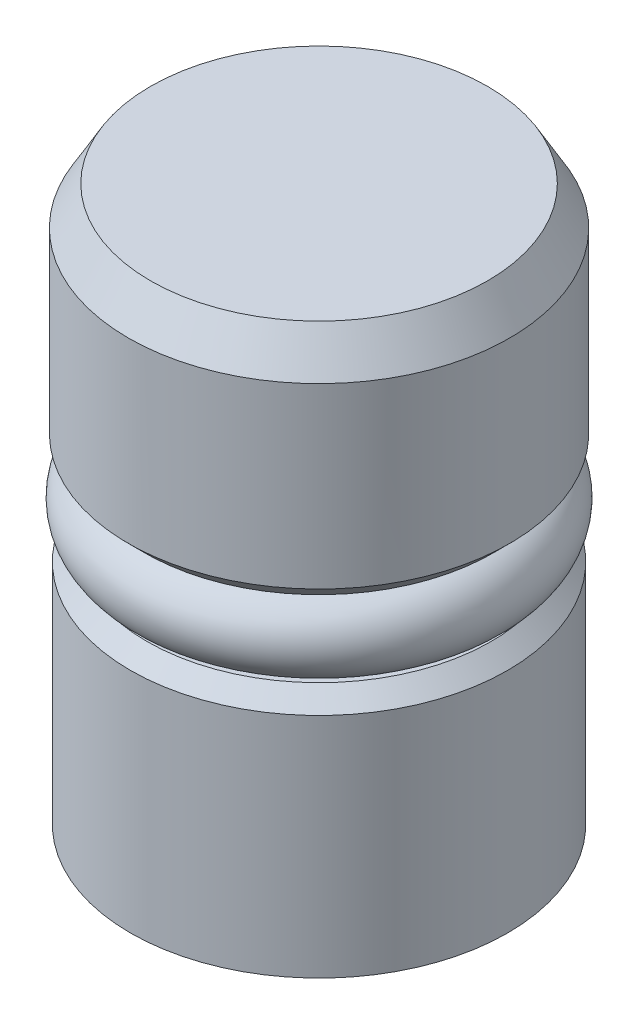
ISO-10303-21;
HEADER;
FILE_DESCRIPTION(('STEP AP214'),'2;1');
FILE_NAME('part.step','',(''),(''),'','','');
FILE_SCHEMA(('AUTOMOTIVE_DESIGN { 1 0 10303 214 1 1 1 1 }'));
ENDSEC;
DATA;
#1=APPLICATION_CONTEXT('core data for automotive mechanical design processes');
#2=APPLICATION_PROTOCOL_DEFINITION('international standard','automotive_design',2000,#1);
#3=PRODUCT_CONTEXT('',#1,'mechanical');
#4=PRODUCT('Part','Part','',(#3));
#5=PRODUCT_RELATED_PRODUCT_CATEGORY('part','',(#4));
#6=PRODUCT_DEFINITION_FORMATION('','',#4);
#7=PRODUCT_DEFINITION_CONTEXT('part definition',#1,'design');
#8=PRODUCT_DEFINITION('design','',#6,#7);
#9=PRODUCT_DEFINITION_SHAPE('','',#8);
#10=(LENGTH_UNIT() NAMED_UNIT(*) SI_UNIT(.MILLI.,.METRE.));
#11=(NAMED_UNIT(*) PLANE_ANGLE_UNIT() SI_UNIT($,.RADIAN.));
#12=(NAMED_UNIT(*) SI_UNIT($,.STERADIAN.) SOLID_ANGLE_UNIT());
#13=UNCERTAINTY_MEASURE_WITH_UNIT(LENGTH_MEASURE(1.E-05),#10,'distance_accuracy_value','');
#14=(GEOMETRIC_REPRESENTATION_CONTEXT(3) GLOBAL_UNCERTAINTY_ASSIGNED_CONTEXT((#13)) GLOBAL_UNIT_ASSIGNED_CONTEXT((#10,
#11,#12)) REPRESENTATION_CONTEXT('',''));
#15=CARTESIAN_POINT('',(0.,0.,0.));
#16=DIRECTION('',(0.,0.,1.));
#17=DIRECTION('',(1.,0.,0.));
#18=AXIS2_PLACEMENT_3D('',#15,#16,#17);
#19=CARTESIAN_POINT('',(0.,6.477,0.));
#20=DIRECTION('',(0.,-1.,0.));
#21=DIRECTION('',(0.,0.,-1.));
#22=AXIS2_PLACEMENT_3D('',#19,#20,#21);
#23=TOROIDAL_SURFACE('',#22,3.5306,0.889);
#24=CARTESIAN_POINT('',(0.,6.477,-4.4196));
#25=VERTEX_POINT('',#24);
#26=VERTEX_LOOP('',#25);
#27=FACE_BOUND('',#26,.T.);
#28=ADVANCED_FACE('P0_F11',(#27),#23,.T.);
#29=CLOSED_SHELL('',(#28));
#30=MANIFOLD_SOLID_BREP('P0_B1',#29);
#31=CARTESIAN_POINT('',(0.,2.4892,0.));
#32=DIRECTION('',(0.,1.,0.));
#33=DIRECTION('',(0.,0.,1.));
#34=AXIS2_PLACEMENT_3D('',#31,#32,#33);
#35=PLANE('',#34);
#36=CARTESIAN_POINT('',(0.,2.4892,0.));
#37=DIRECTION('',(0.,-1.,0.));
#38=DIRECTION('',(0.,0.,-1.));
#39=AXIS2_PLACEMENT_3D('',#36,#37,#38);
#40=CIRCLE('',#39,1.89865);
#41=CARTESIAN_POINT('',(0.,2.4892,-1.89865));
#42=VERTEX_POINT('',#41);
#43=EDGE_CURVE('P1_E47',#42,#42,#40,.T.);
#44=ORIENTED_EDGE('',*,*,#43,.T.);
#45=EDGE_LOOP('',(#44));
#46=FACE_BOUND('',#45,.T.);
#47=CARTESIAN_POINT('',(0.,2.4892,0.));
#48=DIRECTION('',(0.,-1.,0.));
#49=DIRECTION('',(0.,0.,-1.));
#50=AXIS2_PLACEMENT_3D('',#47,#48,#49);
#51=CIRCLE('',#50,1.35255);
#52=CARTESIAN_POINT('',(0.,2.4892,-1.35255));
#53=VERTEX_POINT('',#52);
#54=EDGE_CURVE('P1_E37',#53,#53,#51,.T.);
#55=ORIENTED_EDGE('',*,*,#54,.F.);
#56=EDGE_LOOP('',(#55));
#57=FACE_BOUND('',#56,.T.);
#58=ADVANCED_FACE('P1_F16',(#46,#57),#35,.F.);
#59=CARTESIAN_POINT('',(0.,0.,0.));
#60=DIRECTION('',(0.,-1.,0.));
#61=DIRECTION('',(0.,0.,-1.));
#62=AXIS2_PLACEMENT_3D('',#59,#60,#61);
#63=PLANE('',#62);
#64=CARTESIAN_POINT('',(0.,0.,0.));
#65=DIRECTION('',(0.,-1.,0.));
#66=DIRECTION('',(0.,0.,-1.));
#67=AXIS2_PLACEMENT_3D('',#64,#65,#66);
#68=CIRCLE('',#67,3.9848917);
#69=CARTESIAN_POINT('',(0.,0.,-3.9848917));
#70=VERTEX_POINT('',#69);
#71=EDGE_CURVE('P1_E36',#70,#70,#68,.T.);
#72=ORIENTED_EDGE('',*,*,#71,.F.);
#73=EDGE_LOOP('',(#72));
#74=FACE_BOUND('',#73,.T.);
#75=CARTESIAN_POINT('',(0.,0.,0.));
#76=DIRECTION('',(0.,-1.,0.));
#77=DIRECTION('',(0.,0.,-1.));
#78=AXIS2_PLACEMENT_3D('',#75,#76,#77);
#79=CIRCLE('',#78,4.318);
#80=CARTESIAN_POINT('',(0.,0.,-4.318));
#81=VERTEX_POINT('',#80);
#82=EDGE_CURVE('P1_E56',#81,#81,#79,.T.);
#83=ORIENTED_EDGE('',*,*,#82,.T.);
#84=EDGE_LOOP('',(#83));
#85=FACE_BOUND('',#84,.T.);
#86=ADVANCED_FACE('P1_F88',(#74,#85),#63,.T.);
#87=CARTESIAN_POINT('',(0.,0.,0.));
#88=DIRECTION('',(0.,-1.,0.));
#89=DIRECTION('',(0.,0.,-1.));
#90=AXIS2_PLACEMENT_3D('',#87,#88,#89);
#91=CYLINDRICAL_SURFACE('',#90,4.318);
#92=CARTESIAN_POINT('',(0.,5.207,0.));
#93=DIRECTION('',(0.,1.,0.));
#94=DIRECTION('',(0.,0.,1.));
#95=AXIS2_PLACEMENT_3D('',#92,#93,#94);
#96=CIRCLE('',#95,4.318);
#97=CARTESIAN_POINT('',(0.,5.207,4.318));
#98=VERTEX_POINT('',#97);
#99=EDGE_CURVE('P1_E59',#98,#98,#96,.F.);
#100=ORIENTED_EDGE('',*,*,#99,.T.);
#101=EDGE_LOOP('',(#100));
#102=FACE_BOUND('',#101,.T.);
#103=ORIENTED_EDGE('',*,*,#82,.F.);
#104=EDGE_LOOP('',(#103));
#105=FACE_BOUND('',#104,.T.);
#106=ADVANCED_FACE('P1_F95',(#102,#105),#91,.T.);
#107=CARTESIAN_POINT('',(4.318,5.588,0.));
#108=DIRECTION('',(0.,1.,0.));
#109=DIRECTION('',(0.,0.,1.));
#110=AXIS2_PLACEMENT_3D('',#107,#108,#109);
#111=PLANE('',#110);
#112=CARTESIAN_POINT('',(0.,5.588,0.));
#113=DIRECTION('',(0.,1.,0.));
#114=DIRECTION('',(0.,0.,1.));
#115=AXIS2_PLACEMENT_3D('',#112,#113,#114);
#116=CIRCLE('',#115,3.937);
#117=CARTESIAN_POINT('',(0.,5.588,3.937));
#118=VERTEX_POINT('',#117);
#119=EDGE_CURVE('P1_E62',#118,#118,#116,.T.);
#120=ORIENTED_EDGE('',*,*,#119,.T.);
#121=EDGE_LOOP('',(#120));
#122=FACE_BOUND('',#121,.T.);
#123=CARTESIAN_POINT('',(0.,5.588,0.));
#124=DIRECTION('',(0.,-1.,0.));
#125=DIRECTION('',(0.,0.,-1.));
#126=AXIS2_PLACEMENT_3D('',#123,#124,#125);
#127=CIRCLE('',#126,2.54);
#128=CARTESIAN_POINT('',(0.,5.588,-2.54));
#129=VERTEX_POINT('',#128);
#130=EDGE_CURVE('P1_E53',#129,#129,#127,.T.);
#131=ORIENTED_EDGE('',*,*,#130,.T.);
#132=EDGE_LOOP('',(#131));
#133=FACE_BOUND('',#132,.T.);
#134=ADVANCED_FACE('P1_F116',(#122,#133),#111,.T.);
#135=CARTESIAN_POINT('',(0.,0.,0.));
#136=DIRECTION('',(0.,-1.,0.));
#137=DIRECTION('',(0.,0.,-1.));
#138=AXIS2_PLACEMENT_3D('',#135,#136,#137);
#139=CYLINDRICAL_SURFACE('',#138,2.54);
#140=CARTESIAN_POINT('',(0.,7.366,0.));
#141=DIRECTION('',(0.,-1.,0.));
#142=DIRECTION('',(0.,0.,-1.));
#143=AXIS2_PLACEMENT_3D('',#140,#141,#142);
#144=CIRCLE('',#143,2.54);
#145=CARTESIAN_POINT('',(0.,7.366,-2.54));
#146=VERTEX_POINT('',#145);
#147=EDGE_CURVE('P1_E50',#146,#146,#144,.T.);
#148=ORIENTED_EDGE('',*,*,#147,.T.);
#149=EDGE_LOOP('',(#148));
#150=FACE_BOUND('',#149,.T.);
#151=ORIENTED_EDGE('',*,*,#130,.F.);
#152=EDGE_LOOP('',(#151));
#153=FACE_BOUND('',#152,.T.);
#154=ADVANCED_FACE('P1_F112',(#150,#153),#139,.T.);
#155=CARTESIAN_POINT('',(2.54,7.366,0.));
#156=DIRECTION('',(0.,-1.,0.));
#157=DIRECTION('',(0.,0.,-1.));
#158=AXIS2_PLACEMENT_3D('',#155,#156,#157);
#159=PLANE('',#158);
#160=CARTESIAN_POINT('',(0.,7.366,0.));
#161=DIRECTION('',(0.,-1.,0.));
#162=DIRECTION('',(0.,0.,-1.));
#163=AXIS2_PLACEMENT_3D('',#160,#161,#162);
#164=CIRCLE('',#163,3.984625);
#165=CARTESIAN_POINT('',(0.,7.366,-3.984625));
#166=VERTEX_POINT('',#165);
#167=EDGE_CURVE('P1_E65',#166,#166,#164,.T.);
#168=ORIENTED_EDGE('',*,*,#167,.T.);
#169=EDGE_LOOP('',(#168));
#170=FACE_BOUND('',#169,.T.);
#171=ORIENTED_EDGE('',*,*,#147,.F.);
#172=EDGE_LOOP('',(#171));
#173=FACE_BOUND('',#172,.T.);
#174=ADVANCED_FACE('P1_F109',(#170,#173),#159,.T.);
#175=CARTESIAN_POINT('',(0.,0.,0.));
#176=DIRECTION('',(0.,-1.,0.));
#177=DIRECTION('',(0.,0.,-1.));
#178=AXIS2_PLACEMENT_3D('',#175,#176,#177);
#179=CYLINDRICAL_SURFACE('',#178,4.365625);
#180=CARTESIAN_POINT('',(0.,11.820118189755,0.));
#181=DIRECTION('',(0.,1.,0.));
#182=DIRECTION('',(0.,0.,1.));
#183=AXIS2_PLACEMENT_3D('',#180,#181,#182);
#184=CIRCLE('',#183,4.365625);
#185=CARTESIAN_POINT('',(0.,11.820118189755,4.365625));
#186=VERTEX_POINT('',#185);
#187=EDGE_CURVE('P1_E23',#186,#186,#184,.F.);
#188=ORIENTED_EDGE('',*,*,#187,.T.);
#189=EDGE_LOOP('',(#188));
#190=FACE_BOUND('',#189,.T.);
#191=CARTESIAN_POINT('',(0.,7.747,0.));
#192=DIRECTION('',(0.,-1.,0.));
#193=DIRECTION('',(0.,0.,-1.));
#194=AXIS2_PLACEMENT_3D('',#191,#192,#193);
#195=CIRCLE('',#194,4.365625);
#196=CARTESIAN_POINT('',(0.,7.747,-4.365625));
#197=VERTEX_POINT('',#196);
#198=EDGE_CURVE('P1_E68',#197,#197,#195,.F.);
#199=ORIENTED_EDGE('',*,*,#198,.T.);
#200=EDGE_LOOP('',(#199));
#201=FACE_BOUND('',#200,.T.);
#202=ADVANCED_FACE('P1_F73',(#190,#201),#179,.T.);
#203=CARTESIAN_POINT('',(4.365625,12.7,0.));
#204=DIRECTION('',(0.,1.,0.));
#205=DIRECTION('',(0.,0.,1.));
#206=AXIS2_PLACEMENT_3D('',#203,#204,#205);
#207=PLANE('',#206);
#208=CARTESIAN_POINT('',(0.,12.7,0.));
#209=DIRECTION('',(0.,1.,0.));
#210=DIRECTION('',(0.,0.,1.));
#211=AXIS2_PLACEMENT_3D('',#208,#209,#210);
#212=CIRCLE('',#211,3.857625);
#213=CARTESIAN_POINT('',(0.,12.7,3.857625));
#214=VERTEX_POINT('',#213);
#215=EDGE_CURVE('P1_E11',#214,#214,#212,.T.);
#216=ORIENTED_EDGE('',*,*,#215,.T.);
#217=EDGE_LOOP('',(#216));
#218=FACE_BOUND('',#217,.T.);
#219=ADVANCED_FACE('P1_F103',(#218),#207,.T.);
#220=CARTESIAN_POINT('',(0.,0.,0.));
#221=DIRECTION('',(0.,-1.,0.));
#222=DIRECTION('',(0.,0.,-1.));
#223=AXIS2_PLACEMENT_3D('',#220,#221,#222);
#224=CYLINDRICAL_SURFACE('',#223,1.89865);
#225=ORIENTED_EDGE('',*,*,#43,.F.);
#226=EDGE_LOOP('',(#225));
#227=FACE_BOUND('',#226,.T.);
#228=CARTESIAN_POINT('',(0.,2.39994654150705,0.));
#229=DIRECTION('',(0.,-1.,0.));
#230=DIRECTION('',(0.,0.,-1.));
#231=AXIS2_PLACEMENT_3D('',#228,#229,#230);
#232=CIRCLE('',#231,1.89865);
#233=CARTESIAN_POINT('',(0.,2.39994654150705,-1.89865));
#234=VERTEX_POINT('',#233);
#235=EDGE_CURVE('P1_E40',#234,#234,#232,.T.);
#236=ORIENTED_EDGE('',*,*,#235,.T.);
#237=EDGE_LOOP('',(#236));
#238=FACE_BOUND('',#237,.T.);
#239=ADVANCED_FACE('P1_F101',(#227,#238),#224,.F.);
#240=CARTESIAN_POINT('',(0.,0.,0.));
#241=DIRECTION('',(0.,-1.,0.));
#242=DIRECTION('',(0.,0.,-1.));
#243=AXIS2_PLACEMENT_3D('',#240,#241,#242);
#244=CONICAL_SURFACE('',#243,3.9848917,0.715584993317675);
#245=ORIENTED_EDGE('',*,*,#235,.F.);
#246=EDGE_LOOP('',(#245));
#247=FACE_BOUND('',#246,.T.);
#248=ORIENTED_EDGE('',*,*,#71,.T.);
#249=EDGE_LOOP('',(#248));
#250=FACE_BOUND('',#249,.T.);
#251=ADVANCED_FACE('P1_F30',(#247,#250),#244,.F.);
#252=CARTESIAN_POINT('',(0.,10.414,0.));
#253=DIRECTION('',(0.,-1.,0.));
#254=DIRECTION('',(0.,0.,-1.));
#255=AXIS2_PLACEMENT_3D('',#252,#253,#254);
#256=CONICAL_SURFACE('',#255,1.35255,1.02974425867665);
#257=CARTESIAN_POINT('',(0.,11.2266940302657,0.));
#258=VERTEX_POINT('',#257);
#259=VERTEX_LOOP('',#258);
#260=FACE_BOUND('',#259,.T.);
#261=CARTESIAN_POINT('',(0.,10.414,0.));
#262=DIRECTION('',(0.,-1.,0.));
#263=DIRECTION('',(0.,0.,-1.));
#264=AXIS2_PLACEMENT_3D('',#261,#262,#263);
#265=CIRCLE('',#264,1.35255);
#266=CARTESIAN_POINT('',(0.,10.414,-1.35255));
#267=VERTEX_POINT('',#266);
#268=EDGE_CURVE('P1_E34',#267,#267,#265,.T.);
#269=ORIENTED_EDGE('',*,*,#268,.T.);
#270=EDGE_LOOP('',(#269));
#271=FACE_BOUND('',#270,.T.);
#272=ADVANCED_FACE('P1_F26',(#260,#271),#256,.F.);
#273=CARTESIAN_POINT('',(0.,2.4892,0.));
#274=DIRECTION('',(0.,-1.,0.));
#275=DIRECTION('',(0.,0.,-1.));
#276=AXIS2_PLACEMENT_3D('',#273,#274,#275);
#277=CYLINDRICAL_SURFACE('',#276,1.35255);
#278=ORIENTED_EDGE('',*,*,#268,.F.);
#279=EDGE_LOOP('',(#278));
#280=FACE_BOUND('',#279,.T.);
#281=ORIENTED_EDGE('',*,*,#54,.T.);
#282=EDGE_LOOP('',(#281));
#283=FACE_BOUND('',#282,.T.);
#284=ADVANCED_FACE('P1_F29',(#280,#283),#277,.F.);
#285=CARTESIAN_POINT('',(0.,5.207,0.));
#286=DIRECTION('',(0.,-1.,0.));
#287=DIRECTION('',(0.,0.,-1.));
#288=AXIS2_PLACEMENT_3D('',#285,#286,#287);
#289=CONICAL_SURFACE('',#288,4.318,0.78539816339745);
#290=ORIENTED_EDGE('',*,*,#119,.F.);
#291=EDGE_LOOP('',(#290));
#292=FACE_BOUND('',#291,.T.);
#293=ORIENTED_EDGE('',*,*,#99,.F.);
#294=EDGE_LOOP('',(#293));
#295=FACE_BOUND('',#294,.T.);
#296=ADVANCED_FACE('P1_F84',(#292,#295),#289,.T.);
#297=CARTESIAN_POINT('',(0.,7.366,0.));
#298=DIRECTION('',(0.,1.,0.));
#299=DIRECTION('',(0.,0.,1.));
#300=AXIS2_PLACEMENT_3D('',#297,#298,#299);
#301=CONICAL_SURFACE('',#300,3.984625,0.785398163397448);
#302=ORIENTED_EDGE('',*,*,#198,.F.);
#303=EDGE_LOOP('',(#302));
#304=FACE_BOUND('',#303,.T.);
#305=ORIENTED_EDGE('',*,*,#167,.F.);
#306=EDGE_LOOP('',(#305));
#307=FACE_BOUND('',#306,.T.);
#308=ADVANCED_FACE('P1_F77',(#304,#307),#301,.T.);
#309=CARTESIAN_POINT('',(0.,11.820118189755,0.));
#310=DIRECTION('',(0.,-1.,0.));
#311=DIRECTION('',(0.,0.,-1.));
#312=AXIS2_PLACEMENT_3D('',#309,#310,#311);
#313=CONICAL_SURFACE('',#312,4.365625,0.523598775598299);
#314=ORIENTED_EDGE('',*,*,#215,.F.);
#315=EDGE_LOOP('',(#314));
#316=FACE_BOUND('',#315,.T.);
#317=ORIENTED_EDGE('',*,*,#187,.F.);
#318=EDGE_LOOP('',(#317));
#319=FACE_BOUND('',#318,.T.);
#320=ADVANCED_FACE('P1_F18',(#316,#319),#313,.T.);
#321=CLOSED_SHELL('',(#58,#86,#106,#134,#154,#174,#202,#219,#239,#251,#272,#284,#296,#308,#320));
#322=MANIFOLD_SOLID_BREP('P1_B1',#321);
#323=CARTESIAN_POINT('',(0.,8.03642213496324,0.));
#324=DIRECTION('',(0.,1.,0.));
#325=DIRECTION('',(1.,0.,0.));
#326=AXIS2_PLACEMENT_3D('',#323,#324,#325);
#327=PLANE('',#326);
#328=CARTESIAN_POINT('',(0.,8.03642213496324,0.));
#329=DIRECTION('',(0.,1.,0.));
#330=DIRECTION('',(1.,0.,0.));
#331=AXIS2_PLACEMENT_3D('',#328,#329,#330);
#332=CIRCLE('',#331,1.7526);
#333=CARTESIAN_POINT('',(1.7526,8.03642213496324,0.));
#334=VERTEX_POINT('',#333);
#335=EDGE_CURVE('P2_E10',#334,#334,#332,.T.);
#336=ORIENTED_EDGE('',*,*,#335,.T.);
#337=EDGE_LOOP('',(#336));
#338=FACE_BOUND('',#337,.T.);
#339=ADVANCED_FACE('P2_F15',(#338),#327,.T.);
#340=CARTESIAN_POINT('',(0.,8.03642213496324,0.));
#341=DIRECTION('',(0.,1.,0.));
#342=DIRECTION('',(1.,0.,0.));
#343=AXIS2_PLACEMENT_3D('',#340,#341,#342);
#344=CYLINDRICAL_SURFACE('',#343,1.7526);
#345=CARTESIAN_POINT('',(0.,2.56795784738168,0.));
#346=DIRECTION('',(0.,1.,0.));
#347=DIRECTION('',(1.,0.,0.));
#348=AXIS2_PLACEMENT_3D('',#345,#346,#347);
#349=CIRCLE('',#348,1.7526);
#350=CARTESIAN_POINT('',(1.7526,2.56795784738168,0.));
#351=VERTEX_POINT('',#350);
#352=EDGE_CURVE('P2_E22',#351,#351,#349,.T.);
#353=ORIENTED_EDGE('',*,*,#352,.T.);
#354=EDGE_LOOP('',(#353));
#355=FACE_BOUND('',#354,.T.);
#356=ORIENTED_EDGE('',*,*,#335,.F.);
#357=EDGE_LOOP('',(#356));
#358=FACE_BOUND('',#357,.T.);
#359=ADVANCED_FACE('P2_F126',(#355,#358),#344,.T.);
#360=CARTESIAN_POINT('',(0.,2.56795784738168,0.));
#361=DIRECTION('',(0.,-1.,0.));
#362=DIRECTION('',(-1.,0.,0.));
#363=AXIS2_PLACEMENT_3D('',#360,#361,#362);
#364=CONICAL_SURFACE('',#363,1.7526,0.715584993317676);
#365=CARTESIAN_POINT('',(0.,0.0989221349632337,0.));
#366=DIRECTION('',(0.,1.,0.));
#367=DIRECTION('',(1.,0.,0.));
#368=AXIS2_PLACEMENT_3D('',#365,#366,#367);
#369=CIRCLE('',#368,3.8989);
#370=CARTESIAN_POINT('',(3.8989,0.0989221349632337,0.));
#371=VERTEX_POINT('',#370);
#372=EDGE_CURVE('P2_E116',#371,#371,#369,.T.);
#373=ORIENTED_EDGE('',*,*,#372,.T.);
#374=EDGE_LOOP('',(#373));
#375=FACE_BOUND('',#374,.T.);
#376=ORIENTED_EDGE('',*,*,#352,.F.);
#377=EDGE_LOOP('',(#376));
#378=FACE_BOUND('',#377,.T.);
#379=ADVANCED_FACE('P2_F129',(#375,#378),#364,.T.);
#380=CARTESIAN_POINT('',(0.,0.0989221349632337,3.8989));
#381=DIRECTION('',(0.,-1.,0.));
#382=DIRECTION('',(-1.,0.,0.));
#383=AXIS2_PLACEMENT_3D('',#380,#381,#382);
#384=PLANE('',#383);
#385=DIRECTION('',(0.866025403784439,0.,0.5));
#386=VECTOR('',#385,1.);
#387=CARTESIAN_POINT('',(0.,0.0989221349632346,-1.14384635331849));
#388=LINE('',#387,#386);
#389=CARTESIAN_POINT('',(0.,0.0989221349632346,-1.14384635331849));
#390=VERTEX_POINT('',#389);
#391=CARTESIAN_POINT('',(0.9906,0.0989221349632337,-0.571923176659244));
#392=VERTEX_POINT('',#391);
#393=EDGE_CURVE('P2_E29',#390,#392,#388,.T.);
#394=ORIENTED_EDGE('',*,*,#393,.F.);
#395=DIRECTION('',(0.866025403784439,0.,-0.5));
#396=VECTOR('',#395,1.);
#397=CARTESIAN_POINT('',(-0.9906,0.0989221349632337,-0.571923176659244));
#398=LINE('',#397,#396);
#399=CARTESIAN_POINT('',(-0.9906,0.0989221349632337,-0.571923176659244));
#400=VERTEX_POINT('',#399);
#401=EDGE_CURVE('P2_E112',#400,#390,#398,.T.);
#402=ORIENTED_EDGE('',*,*,#401,.F.);
#403=DIRECTION('',(0.,0.,-1.));
#404=VECTOR('',#403,1.);
#405=CARTESIAN_POINT('',(-0.9906,0.0989221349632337,0.571923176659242));
#406=LINE('',#405,#404);
#407=CARTESIAN_POINT('',(-0.9906,0.0989221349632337,0.571923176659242));
#408=VERTEX_POINT('',#407);
#409=EDGE_CURVE('P2_E110',#408,#400,#406,.T.);
#410=ORIENTED_EDGE('',*,*,#409,.F.);
#411=DIRECTION('',(-0.866025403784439,0.,-0.5));
#412=VECTOR('',#411,1.);
#413=CARTESIAN_POINT('',(0.,0.0989221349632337,1.14384635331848));
#414=LINE('',#413,#412);
#415=CARTESIAN_POINT('',(0.,0.0989221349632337,1.14384635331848));
#416=VERTEX_POINT('',#415);
#417=EDGE_CURVE('P2_E77',#416,#408,#414,.T.);
#418=ORIENTED_EDGE('',*,*,#417,.F.);
#419=DIRECTION('',(-0.866025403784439,0.,0.5));
#420=VECTOR('',#419,1.);
#421=CARTESIAN_POINT('',(0.9906,0.0989221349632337,0.571923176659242));
#422=LINE('',#421,#420);
#423=CARTESIAN_POINT('',(0.9906,0.0989221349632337,0.571923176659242));
#424=VERTEX_POINT('',#423);
#425=EDGE_CURVE('P2_E106',#424,#416,#422,.T.);
#426=ORIENTED_EDGE('',*,*,#425,.F.);
#427=DIRECTION('',(0.,0.,1.));
#428=VECTOR('',#427,1.);
#429=CARTESIAN_POINT('',(0.9906,0.0989221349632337,-0.571923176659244));
#430=LINE('',#429,#428);
#431=EDGE_CURVE('P2_E103',#392,#424,#430,.T.);
#432=ORIENTED_EDGE('',*,*,#431,.F.);
#433=EDGE_LOOP('',(#394,#402,#410,#418,#426,#432));
#434=FACE_BOUND('',#433,.T.);
#435=ORIENTED_EDGE('',*,*,#372,.F.);
#436=EDGE_LOOP('',(#435));
#437=FACE_BOUND('',#436,.T.);
#438=ADVANCED_FACE('P2_F131',(#434,#437),#384,.T.);
#439=CARTESIAN_POINT('',(0.,2.13092213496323,-1.14384635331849));
#440=DIRECTION('',(0.5,0.,-0.866025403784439));
#441=DIRECTION('',(-0.866025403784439,0.,-0.5));
#442=AXIS2_PLACEMENT_3D('',#439,#440,#441);
#443=PLANE('',#442);
#444=ORIENTED_EDGE('',*,*,#393,.T.);
#445=DIRECTION('',(0.,-1.,0.));
#446=VECTOR('',#445,1.);
#447=CARTESIAN_POINT('',(0.9906,2.13092213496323,-0.571923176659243));
#448=LINE('',#447,#446);
#449=CARTESIAN_POINT('',(0.9906,2.13092213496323,-0.571923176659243));
#450=VERTEX_POINT('',#449);
#451=EDGE_CURVE('P2_E59',#450,#392,#448,.T.);
#452=ORIENTED_EDGE('',*,*,#451,.F.);
#453=DIRECTION('',(0.866025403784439,0.,0.5));
#454=VECTOR('',#453,1.);
#455=CARTESIAN_POINT('',(0.,2.13092213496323,-1.14384635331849));
#456=LINE('',#455,#454);
#457=CARTESIAN_POINT('',(0.,2.13092213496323,-1.14384635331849));
#458=VERTEX_POINT('',#457);
#459=EDGE_CURVE('P2_E114',#458,#450,#456,.T.);
#460=ORIENTED_EDGE('',*,*,#459,.F.);
#461=DIRECTION('',(0.,-1.,0.));
#462=VECTOR('',#461,1.);
#463=CARTESIAN_POINT('',(0.,2.13092213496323,-1.14384635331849));
#464=LINE('',#463,#462);
#465=EDGE_CURVE('P2_E37',#458,#390,#464,.T.);
#466=ORIENTED_EDGE('',*,*,#465,.T.);
#467=EDGE_LOOP('',(#444,#452,#460,#466));
#468=FACE_BOUND('',#467,.T.);
#469=ADVANCED_FACE('P2_F140',(#468),#443,.F.);
#470=CARTESIAN_POINT('',(-0.9906,2.13092213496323,-0.571923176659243));
#471=DIRECTION('',(-0.5,0.,-0.866025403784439));
#472=DIRECTION('',(-0.866025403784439,0.,0.5));
#473=AXIS2_PLACEMENT_3D('',#470,#471,#472);
#474=PLANE('',#473);
#475=ORIENTED_EDGE('',*,*,#401,.T.);
#476=ORIENTED_EDGE('',*,*,#465,.F.);
#477=DIRECTION('',(0.866025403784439,0.,-0.5));
#478=VECTOR('',#477,1.);
#479=CARTESIAN_POINT('',(-0.9906,2.13092213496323,-0.571923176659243));
#480=LINE('',#479,#478);
#481=CARTESIAN_POINT('',(-0.9906,2.13092213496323,-0.571923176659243));
#482=VERTEX_POINT('',#481);
#483=EDGE_CURVE('P2_E89',#482,#458,#480,.T.);
#484=ORIENTED_EDGE('',*,*,#483,.F.);
#485=DIRECTION('',(0.,-1.,0.));
#486=VECTOR('',#485,1.);
#487=CARTESIAN_POINT('',(-0.9906,2.13092213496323,-0.571923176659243));
#488=LINE('',#487,#486);
#489=EDGE_CURVE('P2_E81',#482,#400,#488,.T.);
#490=ORIENTED_EDGE('',*,*,#489,.T.);
#491=EDGE_LOOP('',(#475,#476,#484,#490));
#492=FACE_BOUND('',#491,.T.);
#493=ADVANCED_FACE('P2_F179',(#492),#474,.F.);
#494=CARTESIAN_POINT('',(-0.9906,2.13092213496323,0.571923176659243));
#495=DIRECTION('',(-1.,0.,0.));
#496=DIRECTION('',(0.,1.,0.));
#497=AXIS2_PLACEMENT_3D('',#494,#495,#496);
#498=PLANE('',#497);
#499=ORIENTED_EDGE('',*,*,#409,.T.);
#500=ORIENTED_EDGE('',*,*,#489,.F.);
#501=DIRECTION('',(0.,0.,-1.));
#502=VECTOR('',#501,1.);
#503=CARTESIAN_POINT('',(-0.9906,2.13092213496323,0.571923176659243));
#504=LINE('',#503,#502);
#505=CARTESIAN_POINT('',(-0.9906,2.13092213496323,0.571923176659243));
#506=VERTEX_POINT('',#505);
#507=EDGE_CURVE('P2_E85',#506,#482,#504,.T.);
#508=ORIENTED_EDGE('',*,*,#507,.F.);
#509=DIRECTION('',(0.,-1.,0.));
#510=VECTOR('',#509,1.);
#511=CARTESIAN_POINT('',(-0.9906,2.13092213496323,0.571923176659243));
#512=LINE('',#511,#510);
#513=EDGE_CURVE('P2_E70',#506,#408,#512,.T.);
#514=ORIENTED_EDGE('',*,*,#513,.T.);
#515=EDGE_LOOP('',(#499,#500,#508,#514));
#516=FACE_BOUND('',#515,.T.);
#517=ADVANCED_FACE('P2_F86',(#516),#498,.F.);
#518=CARTESIAN_POINT('',(0.,2.13092213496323,1.14384635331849));
#519=DIRECTION('',(-0.5,0.,0.866025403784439));
#520=DIRECTION('',(0.866025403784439,0.,0.5));
#521=AXIS2_PLACEMENT_3D('',#518,#519,#520);
#522=PLANE('',#521);
#523=ORIENTED_EDGE('',*,*,#417,.T.);
#524=ORIENTED_EDGE('',*,*,#513,.F.);
#525=DIRECTION('',(-0.866025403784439,0.,-0.5));
#526=VECTOR('',#525,1.);
#527=CARTESIAN_POINT('',(0.,2.13092213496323,1.14384635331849));
#528=LINE('',#527,#526);
#529=CARTESIAN_POINT('',(0.,2.13092213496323,1.14384635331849));
#530=VERTEX_POINT('',#529);
#531=EDGE_CURVE('P2_E74',#530,#506,#528,.T.);
#532=ORIENTED_EDGE('',*,*,#531,.F.);
#533=DIRECTION('',(0.,-1.,0.));
#534=VECTOR('',#533,1.);
#535=CARTESIAN_POINT('',(0.,2.13092213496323,1.14384635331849));
#536=LINE('',#535,#534);
#537=EDGE_CURVE('P2_E82',#530,#416,#536,.T.);
#538=ORIENTED_EDGE('',*,*,#537,.T.);
#539=EDGE_LOOP('',(#523,#524,#532,#538));
#540=FACE_BOUND('',#539,.T.);
#541=ADVANCED_FACE('P2_F72',(#540),#522,.F.);
#542=CARTESIAN_POINT('',(0.9906,2.13092213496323,0.571923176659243));
#543=DIRECTION('',(0.5,0.,0.866025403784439));
#544=DIRECTION('',(0.866025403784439,0.,-0.5));
#545=AXIS2_PLACEMENT_3D('',#542,#543,#544);
#546=PLANE('',#545);
#547=ORIENTED_EDGE('',*,*,#425,.T.);
#548=ORIENTED_EDGE('',*,*,#537,.F.);
#549=DIRECTION('',(-0.866025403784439,0.,0.5));
#550=VECTOR('',#549,1.);
#551=CARTESIAN_POINT('',(0.9906,2.13092213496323,0.571923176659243));
#552=LINE('',#551,#550);
#553=CARTESIAN_POINT('',(0.9906,2.13092213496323,0.571923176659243));
#554=VERTEX_POINT('',#553);
#555=EDGE_CURVE('P2_E95',#554,#530,#552,.T.);
#556=ORIENTED_EDGE('',*,*,#555,.F.);
#557=DIRECTION('',(0.,-1.,0.));
#558=VECTOR('',#557,1.);
#559=CARTESIAN_POINT('',(0.9906,2.13092213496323,0.571923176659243));
#560=LINE('',#559,#558);
#561=EDGE_CURVE('P2_E119',#554,#424,#560,.T.);
#562=ORIENTED_EDGE('',*,*,#561,.T.);
#563=EDGE_LOOP('',(#547,#548,#556,#562));
#564=FACE_BOUND('',#563,.T.);
#565=ADVANCED_FACE('P2_F200',(#564),#546,.F.);
#566=CARTESIAN_POINT('',(0.9906,2.13092213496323,-0.571923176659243));
#567=DIRECTION('',(1.,0.,0.));
#568=DIRECTION('',(0.,-1.,0.));
#569=AXIS2_PLACEMENT_3D('',#566,#567,#568);
#570=PLANE('',#569);
#571=ORIENTED_EDGE('',*,*,#431,.T.);
#572=ORIENTED_EDGE('',*,*,#561,.F.);
#573=DIRECTION('',(0.,0.,1.));
#574=VECTOR('',#573,1.);
#575=CARTESIAN_POINT('',(0.9906,2.13092213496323,-0.571923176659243));
#576=LINE('',#575,#574);
#577=EDGE_CURVE('P2_E97',#450,#554,#576,.T.);
#578=ORIENTED_EDGE('',*,*,#577,.F.);
#579=ORIENTED_EDGE('',*,*,#451,.T.);
#580=EDGE_LOOP('',(#571,#572,#578,#579));
#581=FACE_BOUND('',#580,.T.);
#582=ADVANCED_FACE('P2_F208',(#581),#570,.F.);
#583=CARTESIAN_POINT('',(0.,2.13092213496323,-1.14384635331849));
#584=DIRECTION('',(0.,1.,0.));
#585=DIRECTION('',(1.,0.,0.));
#586=AXIS2_PLACEMENT_3D('',#583,#584,#585);
#587=PLANE('',#586);
#588=ORIENTED_EDGE('',*,*,#459,.T.);
#589=ORIENTED_EDGE('',*,*,#577,.T.);
#590=ORIENTED_EDGE('',*,*,#555,.T.);
#591=ORIENTED_EDGE('',*,*,#531,.T.);
#592=ORIENTED_EDGE('',*,*,#507,.T.);
#593=ORIENTED_EDGE('',*,*,#483,.T.);
#594=EDGE_LOOP('',(#588,#589,#590,#591,#592,#593));
#595=FACE_BOUND('',#594,.T.);
#596=ADVANCED_FACE('P2_F92',(#595),#587,.F.);
#597=CLOSED_SHELL('',(#339,#359,#379,#438,#469,#493,#517,#541,#565,#582,#596));
#598=MANIFOLD_SOLID_BREP('P2_B1',#597);
#599=ADVANCED_BREP_SHAPE_REPRESENTATION('',(#18,#30,#322,#598),#14);
#600=SHAPE_DEFINITION_REPRESENTATION(#9,#599);
ENDSEC;
END-ISO-10303-21;
